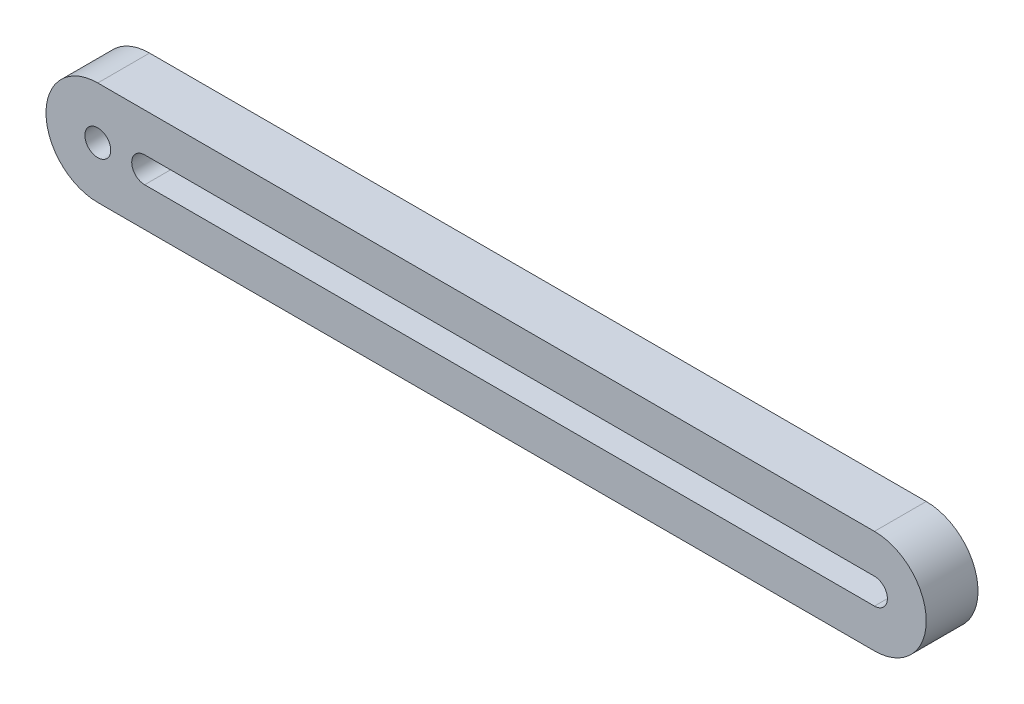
from build123d import *

# Parameters (mm, degrees)
BOSS_EXTRUDE1_DEPTH     = 2.54
SKETCH2_R               = 0.635
CUT_EXTRUDE1_DEPTH      = 41.798441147
CUT_EXTRUDE2_DEPTH      = 41.798441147
CUT_EXTRUDE2_DEPTH_BACK = 41.798441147


with BuildPart() as part:
    # Sketch1 → Boss-Extrude1 (new body)
    with BuildSketch(Plane.XY):
        with BuildLine():
            Line((0, 2.54), (38.1, 2.54))
            ThreePointArc((38.1, 2.54), (40.64, 0), (38.1, -2.54))
            Line((38.1, -2.54), (0, -2.54))
            ThreePointArc((0, -2.54), (-2.54, 0), (0, 2.54))
        make_face()
    extrude(amount=BOSS_EXTRUDE1_DEPTH)

    # Sketch2 → Cut-Extrude1 (cut, symmetric)
    with BuildSketch(Plane.XY.offset(2.54)):
        Circle(SKETCH2_R)
    cut_extrude1 = extrude(amount=CUT_EXTRUDE1_DEPTH, both=True, mode=Mode.SUBTRACT)

    # Mirror1: Cut-Extrude1 across plane
    add(cut_extrude1.mirror(Plane(origin=(19.05, 0, 0), x_dir=(0, 0, 1), z_dir=(1, 0, 0))), mode=Mode.SUBTRACT)

    # Sketch3 → Cut-Extrude2 (cut, two sides: drawn at the far end of the back side and taken through both)
    with BuildSketch(Plane.XY.offset(2.54).offset(-CUT_EXTRUDE2_DEPTH_BACK)):
        with BuildLine():
            Line((2.299956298, 0.635), (38.1, 0.635))
            ThreePointArc((38.1, 0.635), (38.735, 0), (38.1, -0.635))
            Line((38.1, -0.635), (2.299956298, -0.635))
            ThreePointArc((2.299956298, -0.635), (1.664956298, 0), (2.299956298, 0.635))
        make_face()
    extrude(amount=CUT_EXTRUDE2_DEPTH + CUT_EXTRUDE2_DEPTH_BACK, mode=Mode.SUBTRACT)


solid = part.part
